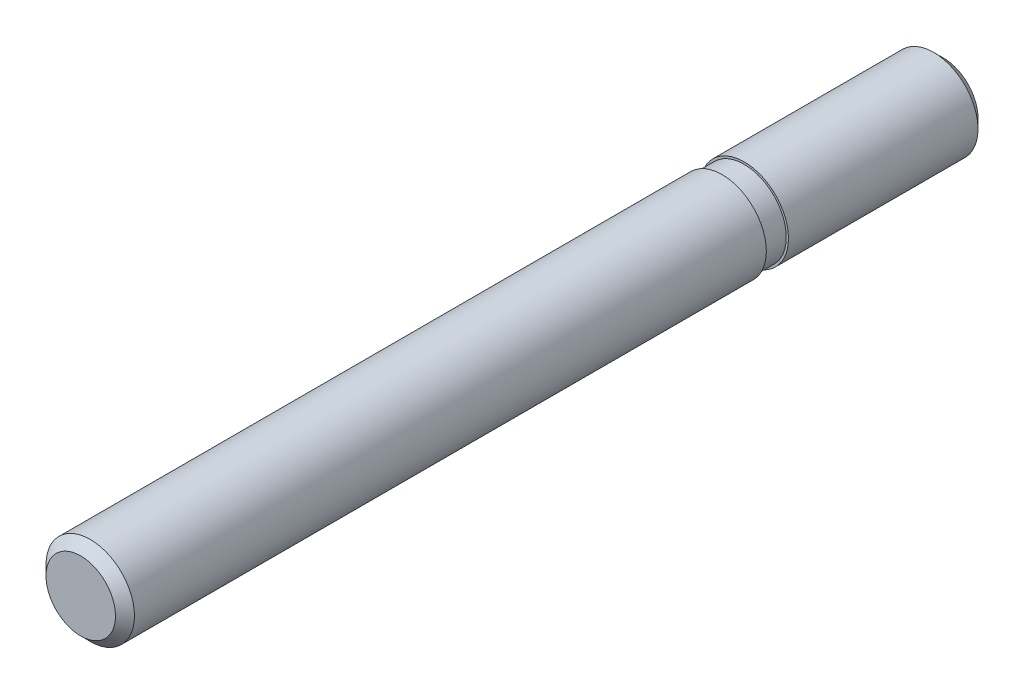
ISO-10303-21;
HEADER;
FILE_DESCRIPTION(('STEP AP214'),'2;1');
FILE_NAME('part.step','',(''),(''),'','','');
FILE_SCHEMA(('AUTOMOTIVE_DESIGN { 1 0 10303 214 1 1 1 1 }'));
ENDSEC;
DATA;
#1=APPLICATION_CONTEXT('core data for automotive mechanical design processes');
#2=APPLICATION_PROTOCOL_DEFINITION('international standard','automotive_design',2000,#1);
#3=PRODUCT_CONTEXT('',#1,'mechanical');
#4=PRODUCT('Part','Part','',(#3));
#5=PRODUCT_RELATED_PRODUCT_CATEGORY('part','',(#4));
#6=PRODUCT_DEFINITION_FORMATION('','',#4);
#7=PRODUCT_DEFINITION_CONTEXT('part definition',#1,'design');
#8=PRODUCT_DEFINITION('design','',#6,#7);
#9=PRODUCT_DEFINITION_SHAPE('','',#8);
#10=(LENGTH_UNIT() NAMED_UNIT(*) SI_UNIT(.MILLI.,.METRE.));
#11=(NAMED_UNIT(*) PLANE_ANGLE_UNIT() SI_UNIT($,.RADIAN.));
#12=(NAMED_UNIT(*) SI_UNIT($,.STERADIAN.) SOLID_ANGLE_UNIT());
#13=UNCERTAINTY_MEASURE_WITH_UNIT(LENGTH_MEASURE(1.E-05),#10,'distance_accuracy_value','');
#14=(GEOMETRIC_REPRESENTATION_CONTEXT(3) GLOBAL_UNCERTAINTY_ASSIGNED_CONTEXT((#13)) GLOBAL_UNIT_ASSIGNED_CONTEXT((#10,
#11,#12)) REPRESENTATION_CONTEXT('',''));
#15=CARTESIAN_POINT('',(0.,0.,0.));
#16=DIRECTION('',(0.,0.,1.));
#17=DIRECTION('',(1.,0.,0.));
#18=AXIS2_PLACEMENT_3D('',#15,#16,#17);
#19=CARTESIAN_POINT('',(0.,0.,0.));
#20=DIRECTION('',(0.,0.,1.));
#21=DIRECTION('',(1.,0.,0.));
#22=AXIS2_PLACEMENT_3D('',#19,#20,#21);
#23=PLANE('',#22);
#24=CARTESIAN_POINT('',(0.,0.,0.));
#25=DIRECTION('',(0.,0.,1.));
#26=DIRECTION('',(1.,0.,0.));
#27=AXIS2_PLACEMENT_3D('',#24,#25,#26);
#28=CIRCLE('',#27,2.);
#29=CARTESIAN_POINT('',(2.,0.,0.));
#30=VERTEX_POINT('',#29);
#31=EDGE_CURVE('E19',#30,#30,#28,.T.);
#32=ORIENTED_EDGE('',*,*,#31,.T.);
#33=EDGE_LOOP('',(#32));
#34=FACE_BOUND('',#33,.T.);
#35=CARTESIAN_POINT('',(0.,0.,0.));
#36=DIRECTION('',(0.,0.,1.));
#37=DIRECTION('',(1.,0.,0.));
#38=AXIS2_PLACEMENT_3D('',#35,#36,#37);
#39=CIRCLE('',#38,1.9);
#40=CARTESIAN_POINT('',(1.9,0.,0.));
#41=VERTEX_POINT('',#40);
#42=EDGE_CURVE('E39',#41,#41,#39,.T.);
#43=ORIENTED_EDGE('',*,*,#42,.F.);
#44=EDGE_LOOP('',(#43));
#45=FACE_BOUND('',#44,.T.);
#46=ADVANCED_FACE('F12',(#34,#45),#23,.T.);
#47=CARTESIAN_POINT('',(0.,0.,7.5));
#48=DIRECTION('',(0.,0.,1.));
#49=DIRECTION('',(1.,0.,0.));
#50=AXIS2_PLACEMENT_3D('',#47,#48,#49);
#51=CYLINDRICAL_SURFACE('',#50,2.);
#52=ORIENTED_EDGE('',*,*,#31,.F.);
#53=EDGE_LOOP('',(#52));
#54=FACE_BOUND('',#53,.T.);
#55=CARTESIAN_POINT('',(0.,0.,-8.5705));
#56=DIRECTION('',(0.,0.,1.));
#57=DIRECTION('',(1.,0.,0.));
#58=AXIS2_PLACEMENT_3D('',#55,#56,#57);
#59=CIRCLE('',#58,2.);
#60=CARTESIAN_POINT('',(2.,0.,-8.5705));
#61=VERTEX_POINT('',#60);
#62=EDGE_CURVE('E33',#61,#61,#59,.T.);
#63=ORIENTED_EDGE('',*,*,#62,.T.);
#64=EDGE_LOOP('',(#63));
#65=FACE_BOUND('',#64,.T.);
#66=ADVANCED_FACE('F48',(#54,#65),#51,.T.);
#67=CARTESIAN_POINT('',(0.,0.78525,-9.));
#68=DIRECTION('',(0.,0.,-1.));
#69=DIRECTION('',(-1.,0.,0.));
#70=AXIS2_PLACEMENT_3D('',#67,#68,#69);
#71=PLANE('',#70);
#72=CARTESIAN_POINT('',(0.,0.,-8.99999999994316));
#73=DIRECTION('',(0.,0.,1.));
#74=DIRECTION('',(1.,0.,0.));
#75=AXIS2_PLACEMENT_3D('',#72,#73,#74);
#76=CIRCLE('',#75,1.57050000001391);
#77=CARTESIAN_POINT('',(1.57050000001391,0.,-8.99999999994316));
#78=VERTEX_POINT('',#77);
#79=EDGE_CURVE('E36',#78,#78,#76,.T.);
#80=ORIENTED_EDGE('',*,*,#79,.F.);
#81=EDGE_LOOP('',(#80));
#82=FACE_BOUND('',#81,.T.);
#83=ADVANCED_FACE('F55',(#82),#71,.T.);
#84=CARTESIAN_POINT('',(0.,0.,-8.5705000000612));
#85=DIRECTION('',(0.,0.,1.));
#86=DIRECTION('',(1.,0.,0.));
#87=AXIS2_PLACEMENT_3D('',#84,#85,#86);
#88=CONICAL_SURFACE('',#87,1.9999999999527,0.785398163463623);
#89=ORIENTED_EDGE('',*,*,#62,.F.);
#90=EDGE_LOOP('',(#89));
#91=FACE_BOUND('',#90,.T.);
#92=ORIENTED_EDGE('',*,*,#79,.T.);
#93=EDGE_LOOP('',(#92));
#94=FACE_BOUND('',#93,.T.);
#95=ADVANCED_FACE('F70',(#91,#94),#88,.T.);
#96=CARTESIAN_POINT('',(0.,0.,4.45805665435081));
#97=DIRECTION('',(0.,0.,1.));
#98=DIRECTION('',(1.,0.,0.));
#99=AXIS2_PLACEMENT_3D('',#96,#97,#98);
#100=CYLINDRICAL_SURFACE('',#99,1.9);
#101=CARTESIAN_POINT('',(0.,0.,1.));
#102=DIRECTION('',(0.,0.,1.));
#103=DIRECTION('',(1.,0.,0.));
#104=AXIS2_PLACEMENT_3D('',#101,#102,#103);
#105=CIRCLE('',#104,1.9);
#106=CARTESIAN_POINT('',(1.9,0.,1.));
#107=VERTEX_POINT('',#106);
#108=EDGE_CURVE('E8',#107,#107,#105,.F.);
#109=ORIENTED_EDGE('',*,*,#108,.T.);
#110=EDGE_LOOP('',(#109));
#111=FACE_BOUND('',#110,.T.);
#112=ORIENTED_EDGE('',*,*,#42,.T.);
#113=EDGE_LOOP('',(#112));
#114=FACE_BOUND('',#113,.T.);
#115=ADVANCED_FACE('F45',(#111,#114),#100,.T.);
#116=CARTESIAN_POINT('',(0.,0.78525,30.));
#117=DIRECTION('',(0.,0.,1.));
#118=DIRECTION('',(1.,0.,0.));
#119=AXIS2_PLACEMENT_3D('',#116,#117,#118);
#120=PLANE('',#119);
#121=CARTESIAN_POINT('',(0.,0.,29.99999999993));
#122=DIRECTION('',(0.,0.,-1.));
#123=DIRECTION('',(-1.,0.,0.));
#124=AXIS2_PLACEMENT_3D('',#121,#122,#123);
#125=CIRCLE('',#124,1.57050000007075);
#126=CARTESIAN_POINT('',(-1.57050000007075,0.,29.99999999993));
#127=VERTEX_POINT('',#126);
#128=EDGE_CURVE('E30',#127,#127,#125,.T.);
#129=ORIENTED_EDGE('',*,*,#128,.F.);
#130=EDGE_LOOP('',(#129));
#131=FACE_BOUND('',#130,.T.);
#132=ADVANCED_FACE('F65',(#131),#120,.T.);
#133=CARTESIAN_POINT('',(0.,0.,29.5705000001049));
#134=DIRECTION('',(0.,0.,-1.));
#135=DIRECTION('',(-1.,0.,0.));
#136=AXIS2_PLACEMENT_3D('',#133,#134,#135);
#137=CONICAL_SURFACE('',#136,1.9999999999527,0.785398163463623);
#138=ORIENTED_EDGE('',*,*,#128,.T.);
#139=EDGE_LOOP('',(#138));
#140=FACE_BOUND('',#139,.T.);
#141=CARTESIAN_POINT('',(0.,0.,29.5705));
#142=DIRECTION('',(0.,0.,1.));
#143=DIRECTION('',(1.,0.,0.));
#144=AXIS2_PLACEMENT_3D('',#141,#142,#143);
#145=CIRCLE('',#144,2.);
#146=CARTESIAN_POINT('',(2.,0.,29.5705));
#147=VERTEX_POINT('',#146);
#148=EDGE_CURVE('E28',#147,#147,#145,.F.);
#149=ORIENTED_EDGE('',*,*,#148,.F.);
#150=EDGE_LOOP('',(#149));
#151=FACE_BOUND('',#150,.T.);
#152=ADVANCED_FACE('F62',(#140,#151),#137,.T.);
#153=CARTESIAN_POINT('',(0.,0.,7.5));
#154=DIRECTION('',(0.,0.,1.));
#155=DIRECTION('',(1.,0.,0.));
#156=AXIS2_PLACEMENT_3D('',#153,#154,#155);
#157=CYLINDRICAL_SURFACE('',#156,2.);
#158=CARTESIAN_POINT('',(0.,0.,1.));
#159=DIRECTION('',(0.,0.,1.));
#160=DIRECTION('',(1.,0.,0.));
#161=AXIS2_PLACEMENT_3D('',#158,#159,#160);
#162=CIRCLE('',#161,2.);
#163=CARTESIAN_POINT('',(2.,0.,1.));
#164=VERTEX_POINT('',#163);
#165=EDGE_CURVE('E23',#164,#164,#162,.T.);
#166=ORIENTED_EDGE('',*,*,#165,.T.);
#167=EDGE_LOOP('',(#166));
#168=FACE_BOUND('',#167,.T.);
#169=ORIENTED_EDGE('',*,*,#148,.T.);
#170=EDGE_LOOP('',(#169));
#171=FACE_BOUND('',#170,.T.);
#172=ADVANCED_FACE('F14',(#168,#171),#157,.T.);
#173=CARTESIAN_POINT('',(0.,0.,1.));
#174=DIRECTION('',(0.,0.,1.));
#175=DIRECTION('',(1.,0.,0.));
#176=AXIS2_PLACEMENT_3D('',#173,#174,#175);
#177=PLANE('',#176);
#178=ORIENTED_EDGE('',*,*,#165,.F.);
#179=EDGE_LOOP('',(#178));
#180=FACE_BOUND('',#179,.T.);
#181=ORIENTED_EDGE('',*,*,#108,.F.);
#182=EDGE_LOOP('',(#181));
#183=FACE_BOUND('',#182,.T.);
#184=ADVANCED_FACE('F58',(#180,#183),#177,.F.);
#185=CLOSED_SHELL('',(#46,#66,#83,#95,#115,#132,#152,#172,#184));
#186=MANIFOLD_SOLID_BREP('B1',#185);
#187=ADVANCED_BREP_SHAPE_REPRESENTATION('',(#18,#186),#14);
#188=SHAPE_DEFINITION_REPRESENTATION(#9,#187);
ENDSEC;
END-ISO-10303-21;
